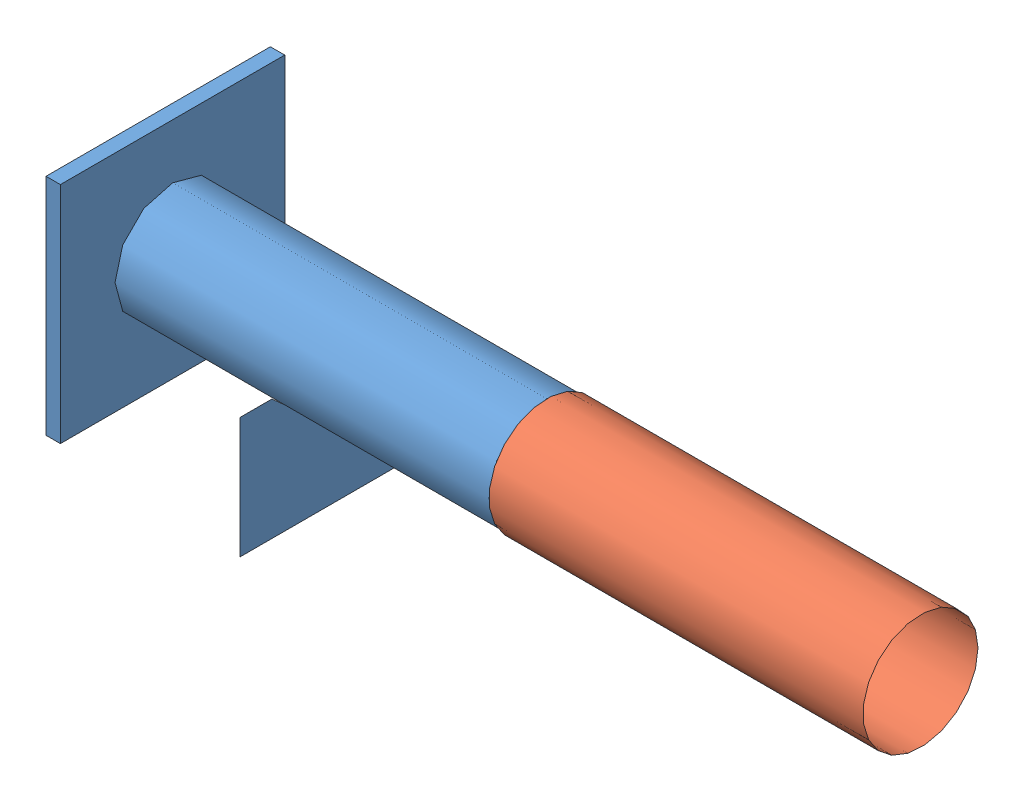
SolidWorks assembly Pipes.SLDASM, configuration Default (file format 15000). Lengths in mm.
Overall size (2650 923.29 780).
2 component instances, 2 part files, 1 mates.
Components (placement in the parent):
- torque tube-1: torque tube.SLDPRT [Default] at (-64.7046 22.7753 2.9732) size (1350 923.29 780)
- Part1-1: Part1.sldprt [Default] at (1235.2954 -33.9911 -85.723) x (0 0 -1) z (1 0 0) size (400 400 1300)
Mates (geometry in assembly coordinates):
- Coincident5: coincident aligned: circle of torque tube-1; circle of Part1-1
